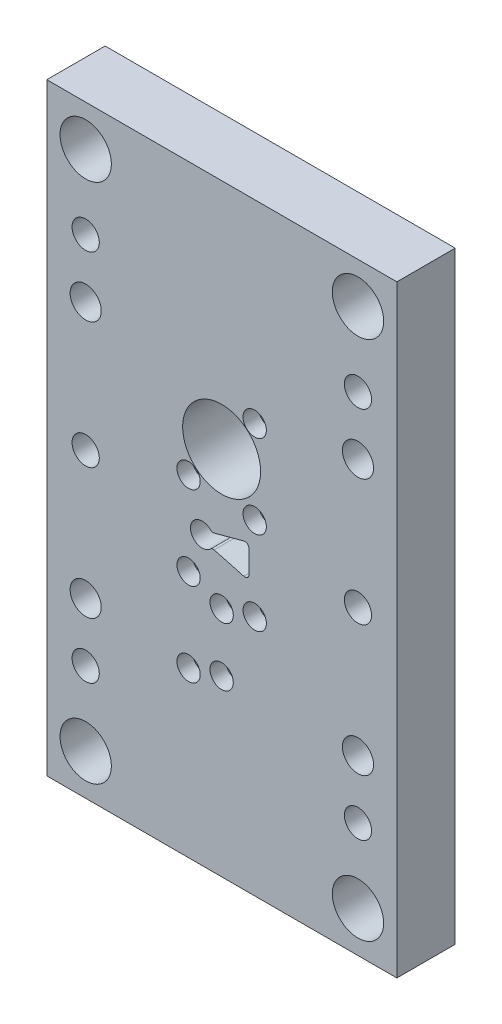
from build123d import *

# Parameters (mm, degrees)
ESQUISSE1_W             = 90
ESQUISSE1_H             = 156
ESQUISSE1_R             = 4.00375
ESQUISSE1_R_2           = 6.6
EXTRUSION1_DEPTH        = 15
TROU_TARAUD_M8X1_01_D   = 7
ESQUISSE4_OUTSIDE_W     = 128.144
ESQUISSE4_OUTSIDE_H     = 194.144
ESQUISSE4_OUTSIDE_W_2   = 90
ESQUISSE4_OUTSIDE_H_2   = 155
ENL_V_MAT_EXTRU_2_DEPTH = 92.290744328
ESQUISSE5_R             = 10.015
ESQUISSE5_R_2           = 1.5025
ENL_V_MAT_EXTRU_3_DEPTH = 91.863909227
ESQUISSE6_R             = 3
ENL_V_MAT_EXTRU_4_DEPTH = 4.01


with BuildPart() as part:
    # Esquisse1 → Extrusion1 (new body)
    with BuildSketch(Plane.XY):
        Rectangle(ESQUISSE1_W, ESQUISSE1_H)
        with Locations((35, 33)):
            Circle(ESQUISSE1_R, mode=Mode.SUBTRACT)
        with Locations((35, -33)):
            Circle(ESQUISSE1_R, mode=Mode.SUBTRACT)
        with Locations((35, 67)):
            Circle(ESQUISSE1_R_2, mode=Mode.SUBTRACT)
        with Locations((35, -67)):
            Circle(ESQUISSE1_R_2, mode=Mode.SUBTRACT)
        with Locations((-35, -33)):
            Circle(ESQUISSE1_R, mode=Mode.SUBTRACT)
        with Locations((-35, 33)):
            Circle(ESQUISSE1_R, mode=Mode.SUBTRACT)
        with Locations((-35, -67)):
            Circle(ESQUISSE1_R_2, mode=Mode.SUBTRACT)
        with Locations((-35, 67)):
            Circle(ESQUISSE1_R_2, mode=Mode.SUBTRACT)
    extrude(amount=EXTRUSION1_DEPTH)

    # Trou taraud_ M8x1.01 (through all)
    with Locations(Plane.XY.offset(15)):
        with Locations((-35, 0), (-35, -48), (35, -48), (-35, 48), (35, 48), (35, 0)):
            Hole(TROU_TARAUD_M8X1_01_D / 2)

    # Esquisse4 outside → Enl_v. mat.-Extru.2 (cut, through all)
    with BuildSketch(Plane.XY.offset(15)):
        Rectangle(ESQUISSE4_OUTSIDE_W, ESQUISSE4_OUTSIDE_H)
        Rectangle(ESQUISSE4_OUTSIDE_W_2, ESQUISSE4_OUTSIDE_H_2, mode=Mode.SUBTRACT)
    extrude(amount=-ENL_V_MAT_EXTRU_2_DEPTH, mode=Mode.SUBTRACT)

    # Esquisse5 → Enl_v. mat.-Extru.3 (cut, through all)
    with BuildSketch(Plane.XY.offset(15)):
        with Locations((-0.05, 17.7)):
            Circle(ESQUISSE5_R)
        with Locations((-8.55, -35.267948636)):
            Circle(ESQUISSE5_R_2)
        with Locations((8.45, -15.332051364)):
            Circle(ESQUISSE5_R_2)
        with Locations((-0.05, -32.8)):
            Circle(ESQUISSE5_R_2)
        with Locations((-0.05, -17.8)):
            Circle(ESQUISSE5_R_2)
        with Locations((-8.55, -13.767948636)):
            Circle(ESQUISSE5_R_2)
        with Locations((8.45, 6.167948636)):
            Circle(ESQUISSE5_R_2)
        with Locations((-8.55, 7.732051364)):
            Circle(ESQUISSE5_R_2)
        with Locations((8.45, 27.667948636)):
            Circle(ESQUISSE5_R_2)
        with BuildLine():
            Line((-1.966636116, -5.676990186), (5.687298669, -7.72785583))
            ThreePointArc((5.687298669, -7.72785583), (6.56789285, -7.552694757), (6.965, -6.747441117))
            Line((6.965, -6.747441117), (6.965, -0.852558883))
            ThreePointArc((6.965, -0.852558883), (6.56789285, -0.047305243), (5.687298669, 0.12785583))
            Line((5.687298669, 0.12785583), (-1.966636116, -1.923009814))
            ThreePointArc((-1.966636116, -1.923009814), (-2.476509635, -1.923009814), (-2.918073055, -1.668073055))
            ThreePointArc((-2.918073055, -1.668073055), (-8.065, -3.8), (-2.918073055, -5.931926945))
            ThreePointArc((-2.918073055, -5.931926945), (-2.476509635, -5.676990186), (-1.966636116, -5.676990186))
        make_face()
    extrude(amount=-ENL_V_MAT_EXTRU_3_DEPTH, mode=Mode.SUBTRACT)

    # Esquisse6 → Enl_v. mat.-Extru.4 (cut)
    with BuildSketch(Plane.XY.offset(15)):
        with Locations((-8.55, -35.267948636)):
            Circle(ESQUISSE6_R)
        with Locations((-0.05, -32.8)):
            Circle(ESQUISSE6_R)
        with Locations((-8.55, -13.767948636)):
            Circle(ESQUISSE6_R)
        with Locations((-0.05, -17.8)):
            Circle(ESQUISSE6_R)
        with Locations((8.45, -15.332051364)):
            Circle(ESQUISSE6_R)
        with Locations((-8.55, 7.732051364)):
            Circle(ESQUISSE6_R)
        with Locations((8.45, 6.167948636)):
            Circle(ESQUISSE6_R)
        with Locations((8.45, 27.667948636)):
            Circle(ESQUISSE6_R)
    extrude(amount=-ENL_V_MAT_EXTRU_4_DEPTH, mode=Mode.SUBTRACT)


solid = part.part
